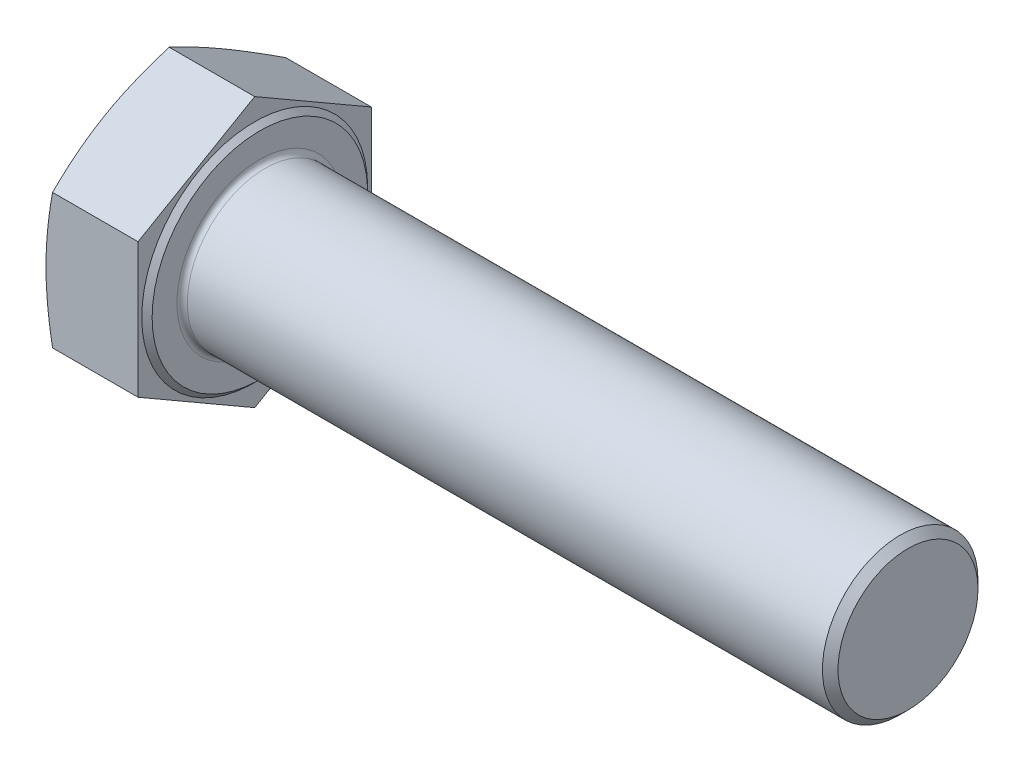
ISO-10303-21;
HEADER;
FILE_DESCRIPTION(('STEP AP214'),'2;1');
FILE_NAME('part.step','',(''),(''),'','','');
FILE_SCHEMA(('AUTOMOTIVE_DESIGN { 1 0 10303 214 1 1 1 1 }'));
ENDSEC;
DATA;
#1=APPLICATION_CONTEXT('core data for automotive mechanical design processes');
#2=APPLICATION_PROTOCOL_DEFINITION('international standard','automotive_design',2000,#1);
#3=PRODUCT_CONTEXT('',#1,'mechanical');
#4=PRODUCT('Part','Part','',(#3));
#5=PRODUCT_RELATED_PRODUCT_CATEGORY('part','',(#4));
#6=PRODUCT_DEFINITION_FORMATION('','',#4);
#7=PRODUCT_DEFINITION_CONTEXT('part definition',#1,'design');
#8=PRODUCT_DEFINITION('design','',#6,#7);
#9=PRODUCT_DEFINITION_SHAPE('','',#8);
#10=(LENGTH_UNIT() NAMED_UNIT(*) SI_UNIT(.MILLI.,.METRE.));
#11=(NAMED_UNIT(*) PLANE_ANGLE_UNIT() SI_UNIT($,.RADIAN.));
#12=(NAMED_UNIT(*) SI_UNIT($,.STERADIAN.) SOLID_ANGLE_UNIT());
#13=UNCERTAINTY_MEASURE_WITH_UNIT(LENGTH_MEASURE(1.E-05),#10,'distance_accuracy_value','');
#14=(GEOMETRIC_REPRESENTATION_CONTEXT(3) GLOBAL_UNCERTAINTY_ASSIGNED_CONTEXT((#13)) GLOBAL_UNIT_ASSIGNED_CONTEXT((#10,
#11,#12)) REPRESENTATION_CONTEXT('',''));
#15=CARTESIAN_POINT('',(0.,0.,0.));
#16=DIRECTION('',(0.,0.,1.));
#17=DIRECTION('',(1.,0.,0.));
#18=AXIS2_PLACEMENT_3D('',#15,#16,#17);
#19=CARTESIAN_POINT('',(15.,-20.7846096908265,0.));
#20=DIRECTION('',(1.,0.,0.));
#21=DIRECTION('',(0.,0.,-1.));
#22=AXIS2_PLACEMENT_3D('',#19,#20,#21);
#23=PLANE('',#22);
#24=CARTESIAN_POINT('',(15.,0.,0.));
#25=DIRECTION('',(1.,0.,0.));
#26=DIRECTION('',(0.,0.,-1.));
#27=AXIS2_PLACEMENT_3D('',#24,#25,#26);
#28=CIRCLE('',#27,12.8);
#29=CARTESIAN_POINT('',(15.,0.,-12.8));
#30=VERTEX_POINT('',#29);
#31=EDGE_CURVE('E11',#30,#30,#28,.F.);
#32=ORIENTED_EDGE('',*,*,#31,.T.);
#33=EDGE_LOOP('',(#32));
#34=FACE_BOUND('',#33,.T.);
#35=CARTESIAN_POINT('',(15.,0.,0.));
#36=DIRECTION('',(-1.,0.,0.));
#37=DIRECTION('',(0.,0.,1.));
#38=AXIS2_PLACEMENT_3D('',#35,#36,#37);
#39=CIRCLE('',#38,16.625);
#40=CARTESIAN_POINT('',(15.,0.,16.625));
#41=VERTEX_POINT('',#40);
#42=EDGE_CURVE('E263',#41,#41,#39,.T.);
#43=ORIENTED_EDGE('',*,*,#42,.F.);
#44=EDGE_LOOP('',(#43));
#45=FACE_BOUND('',#44,.T.);
#46=ADVANCED_FACE('F32',(#34,#45),#23,.T.);
#47=CARTESIAN_POINT('',(15.,-10.3923048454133,18.));
#48=DIRECTION('',(0.,0.866025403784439,-0.5));
#49=DIRECTION('',(0.,0.5,0.866025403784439));
#50=AXIS2_PLACEMENT_3D('',#47,#48,#49);
#51=PLANE('',#50);
#52=CARTESIAN_POINT('',(1.01355706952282,-20.7847251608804,-0.000200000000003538));
#53=CARTESIAN_POINT('',(0.935229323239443,-20.5695062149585,0.372570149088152));
#54=CARTESIAN_POINT('',(0.860424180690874,-20.3539709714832,0.745888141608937));
#55=CARTESIAN_POINT('',(0.718634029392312,-19.9222385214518,1.49367068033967));
#56=CARTESIAN_POINT('',(0.651649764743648,-19.7060412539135,1.86813533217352));
#57=CARTESIAN_POINT('',(0.463525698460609,-19.0561745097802,2.99373755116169));
#58=CARTESIAN_POINT('',(0.355325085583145,-18.6215276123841,3.74656806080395));
#59=CARTESIAN_POINT('',(0.223826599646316,-17.9701027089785,4.87486909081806));
#60=CARTESIAN_POINT('',(0.185238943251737,-17.7540762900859,5.2490378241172));
#61=CARTESIAN_POINT('',(0.118600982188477,-17.3216201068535,5.99807390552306));
#62=CARTESIAN_POINT('',(0.0905502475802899,-17.105190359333,6.37294122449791));
#63=CARTESIAN_POINT('',(0.0454761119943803,-16.6721177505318,7.12304498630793));
#64=CARTESIAN_POINT('',(0.0284489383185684,-16.4554749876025,7.49828125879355));
#65=CARTESIAN_POINT('',(0.00571089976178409,-16.0220405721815,8.24901168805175));
#66=CARTESIAN_POINT('',(0.,-15.8052489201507,8.62450584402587));
#67=CARTESIAN_POINT('',(0.,-15.3716656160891,9.37549415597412));
#68=CARTESIAN_POINT('',(0.00571089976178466,-15.1548739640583,9.75098831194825));
#69=CARTESIAN_POINT('',(0.0284489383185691,-14.7214395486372,10.5017187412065));
#70=CARTESIAN_POINT('',(0.0454761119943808,-14.504796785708,10.8769550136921));
#71=CARTESIAN_POINT('',(0.0905502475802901,-14.0717241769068,11.6270587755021));
#72=CARTESIAN_POINT('',(0.118600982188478,-13.8552944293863,12.0019260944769));
#73=CARTESIAN_POINT('',(0.185238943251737,-13.4228382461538,12.7509621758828));
#74=CARTESIAN_POINT('',(0.223826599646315,-13.2068118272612,13.1251309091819));
#75=CARTESIAN_POINT('',(0.355325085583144,-12.5553869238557,14.253431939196));
#76=CARTESIAN_POINT('',(0.46352569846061,-12.1207400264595,15.0062624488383));
#77=CARTESIAN_POINT('',(0.651649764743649,-11.4708732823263,16.1318646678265));
#78=CARTESIAN_POINT('',(0.718634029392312,-11.254676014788,16.5063293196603));
#79=CARTESIAN_POINT('',(0.860424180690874,-10.8229435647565,17.2541118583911));
#80=CARTESIAN_POINT('',(0.935229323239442,-10.6074083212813,17.6274298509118));
#81=CARTESIAN_POINT('',(1.01355706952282,-10.3921893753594,18.0002));
#82=B_SPLINE_CURVE_WITH_KNOTS('',3,(#52,#53,#54,#55,#56,#57,#58,#59,#60,#61,#62,#63,#64,#65,#66,
#67,#68,#69,#70,#71,#72,#73,#74,#75,#76,#77,#78,#79,#80,#81),.UNSPECIFIED.,.F.,.F.,(4,2,2,2,2,2,
2,2,2,2,2,2,2,2,4),(0.,1.31248077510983,2.62508632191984,5.25211195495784,6.55332710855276,
7.85448916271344,9.15520567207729,10.4559181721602,11.7566306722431,13.0573471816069,
14.3585092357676,15.6597243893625,18.2867500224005,19.5993555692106,20.9118363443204),.UNSPECIFIED.);
#83=CARTESIAN_POINT('',(1.01351504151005,-20.7846096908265,0.));
#84=VERTEX_POINT('',#83);
#85=CARTESIAN_POINT('',(0.,-15.5884572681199,9.));
#86=VERTEX_POINT('',#85);
#87=EDGE_CURVE('E277',#84,#86,#82,.T.);
#88=ORIENTED_EDGE('',*,*,#87,.F.);
#89=DIRECTION('',(-1.,0.,0.));
#90=VECTOR('',#89,1.);
#91=CARTESIAN_POINT('',(15.,-20.7846096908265,0.));
#92=LINE('',#91,#90);
#93=CARTESIAN_POINT('',(14.2,-20.7846096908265,0.));
#94=VERTEX_POINT('',#93);
#95=EDGE_CURVE('E142',#94,#84,#92,.T.);
#96=ORIENTED_EDGE('',*,*,#95,.F.);
#97=DIRECTION('',(0.,-0.5,-0.866025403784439));
#98=VECTOR('',#97,1.);
#99=CARTESIAN_POINT('',(14.2,-10.3923048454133,18.));
#100=LINE('',#99,#98);
#101=CARTESIAN_POINT('',(14.2,-10.3923048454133,18.));
#102=VERTEX_POINT('',#101);
#103=EDGE_CURVE('E133',#102,#94,#100,.T.);
#104=ORIENTED_EDGE('',*,*,#103,.F.);
#105=DIRECTION('',(-1.,0.,0.));
#106=VECTOR('',#105,1.);
#107=CARTESIAN_POINT('',(15.,-10.3923048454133,18.));
#108=LINE('',#107,#106);
#109=CARTESIAN_POINT('',(1.01351504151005,-10.3923048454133,18.));
#110=VERTEX_POINT('',#109);
#111=EDGE_CURVE('E128',#102,#110,#108,.T.);
#112=ORIENTED_EDGE('',*,*,#111,.T.);
#113=EDGE_CURVE('E121',#86,#110,#82,.T.);
#114=ORIENTED_EDGE('',*,*,#113,.F.);
#115=EDGE_LOOP('',(#88,#96,#104,#112,#114));
#116=FACE_BOUND('',#115,.T.);
#117=ADVANCED_FACE('F34',(#116),#51,.F.);
#118=CARTESIAN_POINT('',(15.,-20.7846096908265,0.));
#119=DIRECTION('',(0.,0.866025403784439,0.5));
#120=DIRECTION('',(0.,-0.5,0.866025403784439));
#121=AXIS2_PLACEMENT_3D('',#118,#119,#120);
#122=PLANE('',#121);
#123=CARTESIAN_POINT('',(1.01355706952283,-10.3921893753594,-18.0002));
#124=CARTESIAN_POINT('',(0.935229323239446,-10.6074083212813,-17.6274298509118));
#125=CARTESIAN_POINT('',(0.860424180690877,-10.8229435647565,-17.2541118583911));
#126=CARTESIAN_POINT('',(0.718634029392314,-11.254676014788,-16.5063293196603));
#127=CARTESIAN_POINT('',(0.65164976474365,-11.4708732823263,-16.1318646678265));
#128=CARTESIAN_POINT('',(0.463525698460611,-12.1207400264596,-15.0062624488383));
#129=CARTESIAN_POINT('',(0.355325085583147,-12.5553869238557,-14.253431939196));
#130=CARTESIAN_POINT('',(0.223826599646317,-13.2068118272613,-13.1251309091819));
#131=CARTESIAN_POINT('',(0.185238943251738,-13.4228382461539,-12.7509621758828));
#132=CARTESIAN_POINT('',(0.118600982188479,-13.8552944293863,-12.0019260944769));
#133=CARTESIAN_POINT('',(0.0905502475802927,-14.0717241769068,-11.6270587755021));
#134=CARTESIAN_POINT('',(0.0454761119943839,-14.504796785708,-10.8769550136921));
#135=CARTESIAN_POINT('',(0.0284489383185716,-14.7214395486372,-10.5017187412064));
#136=CARTESIAN_POINT('',(0.00571089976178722,-15.1548739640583,-9.75098831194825));
#137=CARTESIAN_POINT('',(0.,-15.3716656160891,-9.37549415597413));
#138=CARTESIAN_POINT('',(0.,-15.8052489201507,-8.62450584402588));
#139=CARTESIAN_POINT('',(0.00571089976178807,-16.0220405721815,-8.24901168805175));
#140=CARTESIAN_POINT('',(0.028448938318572,-16.4554749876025,-7.49828125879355));
#141=CARTESIAN_POINT('',(0.0454761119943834,-16.6721177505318,-7.12304498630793));
#142=CARTESIAN_POINT('',(0.0905502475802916,-17.105190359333,-6.37294122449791));
#143=CARTESIAN_POINT('',(0.118600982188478,-17.3216201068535,-5.99807390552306));
#144=CARTESIAN_POINT('',(0.185238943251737,-17.7540762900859,-5.24903782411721));
#145=CARTESIAN_POINT('',(0.223826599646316,-17.9701027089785,-4.87486909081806));
#146=CARTESIAN_POINT('',(0.355325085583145,-18.6215276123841,-3.74656806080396));
#147=CARTESIAN_POINT('',(0.463525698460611,-19.0561745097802,-2.99373755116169));
#148=CARTESIAN_POINT('',(0.65164976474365,-19.7060412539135,-1.86813533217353));
#149=CARTESIAN_POINT('',(0.718634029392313,-19.9222385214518,-1.49367068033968));
#150=CARTESIAN_POINT('',(0.860424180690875,-20.3539709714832,-0.745888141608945));
#151=CARTESIAN_POINT('',(0.935229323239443,-20.5695062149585,-0.372570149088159));
#152=CARTESIAN_POINT('',(1.01355706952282,-20.7847251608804,0.000199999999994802));
#153=B_SPLINE_CURVE_WITH_KNOTS('',3,(#123,#124,#125,#126,#127,#128,#129,#130,#131,#132,#133,
#134,#135,#136,#137,#138,#139,#140,#141,#142,#143,#144,#145,#146,#147,#148,#149,#150,#151,#152),
.UNSPECIFIED.,.F.,.F.,(4,2,2,2,2,2,2,2,2,2,2,2,2,2,4),(0.,1.31248077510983,2.62508632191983,
5.25211195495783,6.55332710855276,7.85448916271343,9.15520567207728,10.4559181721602,
11.7566306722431,13.0573471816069,14.3585092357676,15.6597243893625,18.2867500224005,
19.5993555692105,20.9118363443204),.UNSPECIFIED.);
#154=CARTESIAN_POINT('',(1.01351504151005,-10.3923048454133,-18.));
#155=VERTEX_POINT('',#154);
#156=CARTESIAN_POINT('',(0.,-15.5884572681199,-9.));
#157=VERTEX_POINT('',#156);
#158=EDGE_CURVE('E230',#155,#157,#153,.T.);
#159=ORIENTED_EDGE('',*,*,#158,.F.);
#160=DIRECTION('',(-1.,0.,0.));
#161=VECTOR('',#160,1.);
#162=CARTESIAN_POINT('',(15.,-10.3923048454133,-18.));
#163=LINE('',#162,#161);
#164=CARTESIAN_POINT('',(14.2,-10.3923048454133,-18.));
#165=VERTEX_POINT('',#164);
#166=EDGE_CURVE('E139',#165,#155,#163,.T.);
#167=ORIENTED_EDGE('',*,*,#166,.F.);
#168=DIRECTION('',(0.,0.5,-0.866025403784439));
#169=VECTOR('',#168,1.);
#170=CARTESIAN_POINT('',(14.2,-20.7846096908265,0.));
#171=LINE('',#170,#169);
#172=EDGE_CURVE('E267',#94,#165,#171,.T.);
#173=ORIENTED_EDGE('',*,*,#172,.F.);
#174=ORIENTED_EDGE('',*,*,#95,.T.);
#175=EDGE_CURVE('E226',#157,#84,#153,.T.);
#176=ORIENTED_EDGE('',*,*,#175,.F.);
#177=EDGE_LOOP('',(#159,#167,#173,#174,#176));
#178=FACE_BOUND('',#177,.T.);
#179=ADVANCED_FACE('F180',(#178),#122,.F.);
#180=CARTESIAN_POINT('',(15.,-10.3923048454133,-18.));
#181=DIRECTION('',(0.,0.,1.));
#182=DIRECTION('',(1.,0.,0.));
#183=AXIS2_PLACEMENT_3D('',#180,#181,#182);
#184=PLANE('',#183);
#185=CARTESIAN_POINT('',(5.41582244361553,-27.5151690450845,-18.));
#186=CARTESIAN_POINT('',(5.2918021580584,-27.1079824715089,-18.));
#187=CARTESIAN_POINT('',(5.16853188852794,-26.7005675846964,-18.));
#188=CARTESIAN_POINT('',(4.92365928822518,-25.8852344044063,-18.));
#189=CARTESIAN_POINT('',(4.80205696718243,-25.4773161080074,-18.));
#190=CARTESIAN_POINT('',(4.43998810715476,-24.2526827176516,-18.));
#191=CARTESIAN_POINT('',(4.20227805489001,-23.4351493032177,-18.));
#192=CARTESIAN_POINT('',(3.73546671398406,-21.7959728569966,-18.));
#193=CARTESIAN_POINT('',(3.50638231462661,-20.9743250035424,-18.));
#194=CARTESIAN_POINT('',(3.05948461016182,-19.3279732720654,-18.));
#195=CARTESIAN_POINT('',(2.84167110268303,-18.5032694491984,-18.));
#196=CARTESIAN_POINT('',(2.42271166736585,-16.8604466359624,-18.));
#197=CARTESIAN_POINT('',(2.22139334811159,-16.0423718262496,-18.));
#198=CARTESIAN_POINT('',(1.83589627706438,-14.4021513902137,-18.));
#199=CARTESIAN_POINT('',(1.6517178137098,-13.5800056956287,-18.));
#200=CARTESIAN_POINT('',(1.30479477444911,-11.9314594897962,-18.));
#201=CARTESIAN_POINT('',(1.14204288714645,-11.1050605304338,-18.));
#202=CARTESIAN_POINT('',(0.842928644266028,-9.44746479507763,-18.));
#203=CARTESIAN_POINT('',(0.706565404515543,-8.61626818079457,-18.));
#204=CARTESIAN_POINT('',(0.479270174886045,-7.0426731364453,-18.));
#205=CARTESIAN_POINT('',(0.384958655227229,-6.30076744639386,-18.));
#206=CARTESIAN_POINT('',(0.225311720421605,-4.81381892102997,-18.));
#207=CARTESIAN_POINT('',(0.159975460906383,-4.06877617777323,-18.));
#208=CARTESIAN_POINT('',(0.0614255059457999,-2.57706476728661,-18.));
#209=CARTESIAN_POINT('',(0.0281890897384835,-1.83039762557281,-18.));
#210=CARTESIAN_POINT('',(-0.00447842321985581,-0.336316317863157,-18.));
#211=CARTESIAN_POINT('',(-0.0039097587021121,0.411097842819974,-18.));
#212=CARTESIAN_POINT('',(0.0310905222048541,1.90891227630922,-18.));
#213=CARTESIAN_POINT('',(0.065693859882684,2.65930846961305,-18.));
#214=CARTESIAN_POINT('',(0.167171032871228,4.15789675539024,-18.));
#215=CARTESIAN_POINT('',(0.234045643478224,4.90608879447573,-18.));
#216=CARTESIAN_POINT('',(0.39693700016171,6.39989932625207,-18.));
#217=CARTESIAN_POINT('',(0.49297877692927,7.1455150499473,-18.));
#218=CARTESIAN_POINT('',(0.710308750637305,8.63301636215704,-18.));
#219=CARTESIAN_POINT('',(0.831597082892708,9.37490193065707,-18.));
#220=CARTESIAN_POINT('',(1.1024521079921,10.8939822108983,-18.));
#221=CARTESIAN_POINT('',(1.25317523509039,11.6709688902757,-18.));
#222=CARTESIAN_POINT('',(1.57402044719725,13.2209522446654,-18.));
#223=CARTESIAN_POINT('',(1.74414399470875,13.9939486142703,-18.));
#224=CARTESIAN_POINT('',(2.10021780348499,15.5365021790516,-18.));
#225=CARTESIAN_POINT('',(2.28617266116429,16.3060583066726,-18.));
#226=CARTESIAN_POINT('',(2.67088415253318,17.8419287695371,-18.));
#227=CARTESIAN_POINT('',(2.86964047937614,18.6082431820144,-18.));
#228=CARTESIAN_POINT('',(3.27782395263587,20.139068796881,-18.));
#229=CARTESIAN_POINT('',(3.48726447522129,20.9035764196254,-18.));
#230=CARTESIAN_POINT('',(3.91466536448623,22.4302031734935,-18.));
#231=CARTESIAN_POINT('',(4.1326257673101,23.1923222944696,-18.));
#232=CARTESIAN_POINT('',(4.57550689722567,24.7143923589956,-18.));
#233=CARTESIAN_POINT('',(4.80042645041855,25.4743436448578,-18.));
#234=CARTESIAN_POINT('',(5.25605194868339,26.9925048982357,-18.));
#235=CARTESIAN_POINT('',(5.48675788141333,27.7507148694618,-18.));
#236=CARTESIAN_POINT('',(5.95041678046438,29.2572852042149,-18.));
#237=CARTESIAN_POINT('',(6.1833168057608,30.0056618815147,-18.));
#238=CARTESIAN_POINT('',(6.65308922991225,31.5011682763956,-18.));
#239=CARTESIAN_POINT('',(6.88996164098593,32.2482979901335,-18.));
#240=CARTESIAN_POINT('',(7.6056155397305,34.4881493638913,-18.));
#241=CARTESIAN_POINT('',(8.08941377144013,35.9792689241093,-18.));
#242=CARTESIAN_POINT('',(8.82151197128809,38.2107066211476,-18.));
#243=CARTESIAN_POINT('',(9.06613879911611,38.9522359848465,-18.));
#244=CARTESIAN_POINT('',(9.55750817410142,40.4345945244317,-18.));
#245=CARTESIAN_POINT('',(9.80425072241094,41.1754236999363,-18.));
#246=CARTESIAN_POINT('',(10.2995471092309,42.6564083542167,-18.));
#247=CARTESIAN_POINT('',(10.5481007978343,43.3965638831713,-18.));
#248=CARTESIAN_POINT('',(11.0468164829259,44.8763309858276,-18.));
#249=CARTESIAN_POINT('',(11.2969784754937,45.6159425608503,-18.));
#250=CARTESIAN_POINT('',(11.5478337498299,46.355318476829,-18.));
#251=B_SPLINE_CURVE_WITH_KNOTS('',3,(#185,#186,#187,#188,#189,#190,#191,#192,#193,#194,#195,
#196,#197,#198,#199,#200,#201,#202,#203,#204,#205,#206,#207,#208,#209,#210,#211,#212,#213,#214,
#215,#216,#217,#218,#219,#220,#221,#222,#223,#224,#225,#226,#227,#228,#229,#230,#231,#232,#233,
#234,#235,#236,#237,#238,#239,#240,#241,#242,#243,#244,#245,#246,#247,#248,#249,#250),
.UNSPECIFIED.,.F.,.F.,(4,2,2,2,2,2,2,2,2,2,2,2,2,2,2,2,2,2,2,2,2,2,2,2,2,2,2,2,2,2,2,2,4),(0.,
1.27696278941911,2.55393302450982,5.10806226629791,7.6669568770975,10.2258055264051,
12.7531049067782,15.280446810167,17.8069240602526,20.3333166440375,22.576452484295,
24.8195229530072,27.0610045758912,29.3024703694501,31.555303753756,33.8081912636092,
36.0630176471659,38.3178561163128,40.6919643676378,43.0662517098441,45.4412307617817,
47.8161529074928,50.1941250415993,52.5721072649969,54.9496905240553,57.3272687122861,
59.6785935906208,62.0299257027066,66.7327919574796,69.075304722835,71.4178187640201,
73.7601410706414,76.1024576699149),.UNSPECIFIED.);
#252=CARTESIAN_POINT('',(1.01351504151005,10.3923048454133,-18.));
#253=VERTEX_POINT('',#252);
#254=CARTESIAN_POINT('',(0.,0.,-18.));
#255=VERTEX_POINT('',#254);
#256=EDGE_CURVE('E293',#253,#255,#251,.F.);
#257=ORIENTED_EDGE('',*,*,#256,.F.);
#258=DIRECTION('',(-1.,0.,0.));
#259=VECTOR('',#258,1.);
#260=CARTESIAN_POINT('',(15.,10.3923048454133,-18.));
#261=LINE('',#260,#259);
#262=CARTESIAN_POINT('',(14.2,10.3923048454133,-18.));
#263=VERTEX_POINT('',#262);
#264=EDGE_CURVE('E130',#263,#253,#261,.T.);
#265=ORIENTED_EDGE('',*,*,#264,.F.);
#266=DIRECTION('',(0.,1.,0.));
#267=VECTOR('',#266,1.);
#268=CARTESIAN_POINT('',(14.2,-10.3923048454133,-18.));
#269=LINE('',#268,#267);
#270=EDGE_CURVE('E260',#165,#263,#269,.T.);
#271=ORIENTED_EDGE('',*,*,#270,.F.);
#272=ORIENTED_EDGE('',*,*,#166,.T.);
#273=EDGE_CURVE('E231',#255,#155,#251,.F.);
#274=ORIENTED_EDGE('',*,*,#273,.F.);
#275=EDGE_LOOP('',(#257,#265,#271,#272,#274));
#276=FACE_BOUND('',#275,.T.);
#277=ADVANCED_FACE('F239',(#276),#184,.F.);
#278=CARTESIAN_POINT('',(15.,10.3923048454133,-18.));
#279=DIRECTION('',(0.,-0.866025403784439,0.5));
#280=DIRECTION('',(0.,-0.5,-0.866025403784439));
#281=AXIS2_PLACEMENT_3D('',#278,#279,#280);
#282=PLANE('',#281);
#283=CARTESIAN_POINT('',(1.01355706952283,20.7847251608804,0.000199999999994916));
#284=CARTESIAN_POINT('',(0.93522932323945,20.5695062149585,-0.372570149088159));
#285=CARTESIAN_POINT('',(0.860424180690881,20.3539709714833,-0.745888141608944));
#286=CARTESIAN_POINT('',(0.71863402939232,19.9222385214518,-1.49367068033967));
#287=CARTESIAN_POINT('',(0.651649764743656,19.7060412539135,-1.86813533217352));
#288=CARTESIAN_POINT('',(0.463525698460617,19.0561745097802,-2.99373755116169));
#289=CARTESIAN_POINT('',(0.355325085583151,18.6215276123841,-3.74656806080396));
#290=CARTESIAN_POINT('',(0.223826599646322,17.9701027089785,-4.87486909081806));
#291=CARTESIAN_POINT('',(0.185238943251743,17.7540762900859,-5.24903782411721));
#292=CARTESIAN_POINT('',(0.118600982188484,17.3216201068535,-5.99807390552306));
#293=CARTESIAN_POINT('',(0.0905502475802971,17.105190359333,-6.37294122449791));
#294=CARTESIAN_POINT('',(0.0454761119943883,16.6721177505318,-7.12304498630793));
#295=CARTESIAN_POINT('',(0.0284489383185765,16.4554749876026,-7.49828125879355));
#296=CARTESIAN_POINT('',(0.00571089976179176,16.0220405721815,-8.24901168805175));
#297=CARTESIAN_POINT('',(0.,15.8052489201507,-8.62450584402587));
#298=CARTESIAN_POINT('',(0.,15.3716656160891,-9.37549415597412));
#299=CARTESIAN_POINT('',(0.00571089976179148,15.1548739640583,-9.75098831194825));
#300=CARTESIAN_POINT('',(0.0284489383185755,14.7214395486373,-10.5017187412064));
#301=CARTESIAN_POINT('',(0.0454761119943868,14.504796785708,-10.8769550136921));
#302=CARTESIAN_POINT('',(0.0905502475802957,14.0717241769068,-11.6270587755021));
#303=CARTESIAN_POINT('',(0.118600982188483,13.8552944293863,-12.0019260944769));
#304=CARTESIAN_POINT('',(0.185238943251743,13.4228382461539,-12.7509621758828));
#305=CARTESIAN_POINT('',(0.223826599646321,13.2068118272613,-13.1251309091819));
#306=CARTESIAN_POINT('',(0.35532508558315,12.5553869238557,-14.253431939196));
#307=CARTESIAN_POINT('',(0.463525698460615,12.1207400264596,-15.0062624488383));
#308=CARTESIAN_POINT('',(0.651649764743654,11.4708732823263,-16.1318646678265));
#309=CARTESIAN_POINT('',(0.718634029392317,11.254676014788,-16.5063293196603));
#310=CARTESIAN_POINT('',(0.860424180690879,10.8229435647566,-17.2541118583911));
#311=CARTESIAN_POINT('',(0.935229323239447,10.6074083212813,-17.6274298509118));
#312=CARTESIAN_POINT('',(1.01355706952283,10.3921893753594,-18.0002));
#313=B_SPLINE_CURVE_WITH_KNOTS('',3,(#283,#284,#285,#286,#287,#288,#289,#290,#291,#292,#293,
#294,#295,#296,#297,#298,#299,#300,#301,#302,#303,#304,#305,#306,#307,#308,#309,#310,#311,#312),
.UNSPECIFIED.,.F.,.F.,(4,2,2,2,2,2,2,2,2,2,2,2,2,2,4),(0.,1.31248077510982,2.62508632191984,
5.25211195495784,6.55332710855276,7.85448916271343,9.15520567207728,10.4559181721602,
11.7566306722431,13.0573471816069,14.3585092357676,15.6597243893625,18.2867500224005,
19.5993555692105,20.9118363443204),.UNSPECIFIED.);
#314=CARTESIAN_POINT('',(1.01351504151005,20.7846096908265,0.));
#315=VERTEX_POINT('',#314);
#316=CARTESIAN_POINT('',(0.,15.5884572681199,-9.));
#317=VERTEX_POINT('',#316);
#318=EDGE_CURVE('E48',#315,#317,#313,.T.);
#319=ORIENTED_EDGE('',*,*,#318,.F.);
#320=DIRECTION('',(-1.,0.,0.));
#321=VECTOR('',#320,1.);
#322=CARTESIAN_POINT('',(15.,20.7846096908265,0.));
#323=LINE('',#322,#321);
#324=CARTESIAN_POINT('',(14.2,20.7846096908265,0.));
#325=VERTEX_POINT('',#324);
#326=EDGE_CURVE('E127',#325,#315,#323,.T.);
#327=ORIENTED_EDGE('',*,*,#326,.F.);
#328=DIRECTION('',(0.,0.5,0.866025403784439));
#329=VECTOR('',#328,1.);
#330=CARTESIAN_POINT('',(14.2,10.3923048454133,-18.));
#331=LINE('',#330,#329);
#332=EDGE_CURVE('E257',#263,#325,#331,.T.);
#333=ORIENTED_EDGE('',*,*,#332,.F.);
#334=ORIENTED_EDGE('',*,*,#264,.T.);
#335=EDGE_CURVE('E254',#317,#253,#313,.T.);
#336=ORIENTED_EDGE('',*,*,#335,.F.);
#337=EDGE_LOOP('',(#319,#327,#333,#334,#336));
#338=FACE_BOUND('',#337,.T.);
#339=ADVANCED_FACE('F243',(#338),#282,.F.);
#340=CARTESIAN_POINT('',(15.,20.7846096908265,0.));
#341=DIRECTION('',(0.,-0.866025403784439,-0.5));
#342=DIRECTION('',(0.,0.5,-0.866025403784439));
#343=AXIS2_PLACEMENT_3D('',#340,#341,#342);
#344=PLANE('',#343);
#345=CARTESIAN_POINT('',(1.01355706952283,10.3921893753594,18.0002));
#346=CARTESIAN_POINT('',(0.935229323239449,10.6074083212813,17.6274298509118));
#347=CARTESIAN_POINT('',(0.860424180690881,10.8229435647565,17.2541118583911));
#348=CARTESIAN_POINT('',(0.718634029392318,11.254676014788,16.5063293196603));
#349=CARTESIAN_POINT('',(0.651649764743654,11.4708732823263,16.1318646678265));
#350=CARTESIAN_POINT('',(0.463525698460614,12.1207400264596,15.0062624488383));
#351=CARTESIAN_POINT('',(0.35532508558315,12.5553869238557,14.253431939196));
#352=CARTESIAN_POINT('',(0.223826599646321,13.2068118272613,13.1251309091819));
#353=CARTESIAN_POINT('',(0.185238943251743,13.4228382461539,12.7509621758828));
#354=CARTESIAN_POINT('',(0.118600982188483,13.8552944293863,12.0019260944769));
#355=CARTESIAN_POINT('',(0.0905502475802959,14.0717241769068,11.6270587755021));
#356=CARTESIAN_POINT('',(0.045476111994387,14.504796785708,10.8769550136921));
#357=CARTESIAN_POINT('',(0.0284489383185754,14.7214395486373,10.5017187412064));
#358=CARTESIAN_POINT('',(0.00571089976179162,15.1548739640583,9.75098831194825));
#359=CARTESIAN_POINT('',(0.,15.3716656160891,9.37549415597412));
#360=CARTESIAN_POINT('',(0.,15.8052489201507,8.62450584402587));
#361=CARTESIAN_POINT('',(0.00571089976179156,16.0220405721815,8.24901168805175));
#362=CARTESIAN_POINT('',(0.0284489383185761,16.4554749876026,7.49828125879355));
#363=CARTESIAN_POINT('',(0.0454761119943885,16.6721177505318,7.12304498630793));
#364=CARTESIAN_POINT('',(0.0905502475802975,17.105190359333,6.3729412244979));
#365=CARTESIAN_POINT('',(0.118600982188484,17.3216201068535,5.99807390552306));
#366=CARTESIAN_POINT('',(0.185238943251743,17.7540762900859,5.2490378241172));
#367=CARTESIAN_POINT('',(0.223826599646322,17.9701027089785,4.87486909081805));
#368=CARTESIAN_POINT('',(0.355325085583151,18.6215276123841,3.74656806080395));
#369=CARTESIAN_POINT('',(0.463525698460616,19.0561745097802,2.99373755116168));
#370=CARTESIAN_POINT('',(0.651649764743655,19.7060412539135,1.86813533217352));
#371=CARTESIAN_POINT('',(0.71863402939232,19.9222385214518,1.49367068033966));
#372=CARTESIAN_POINT('',(0.860424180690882,20.3539709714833,0.745888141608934));
#373=CARTESIAN_POINT('',(0.93522932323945,20.5695062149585,0.372570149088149));
#374=CARTESIAN_POINT('',(1.01355706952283,20.7847251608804,-0.000200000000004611));
#375=B_SPLINE_CURVE_WITH_KNOTS('',3,(#345,#346,#347,#348,#349,#350,#351,#352,#353,#354,#355,
#356,#357,#358,#359,#360,#361,#362,#363,#364,#365,#366,#367,#368,#369,#370,#371,#372,#373,#374),
.UNSPECIFIED.,.F.,.F.,(4,2,2,2,2,2,2,2,2,2,2,2,2,2,4),(0.,1.31248077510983,2.62508632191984,
5.25211195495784,6.55332710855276,7.85448916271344,9.15520567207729,10.4559181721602,
11.7566306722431,13.0573471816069,14.3585092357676,15.6597243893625,18.2867500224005,
19.5993555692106,20.9118363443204),.UNSPECIFIED.);
#376=CARTESIAN_POINT('',(1.01351504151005,10.3923048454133,18.));
#377=VERTEX_POINT('',#376);
#378=CARTESIAN_POINT('',(0.,15.5884572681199,9.));
#379=VERTEX_POINT('',#378);
#380=EDGE_CURVE('E56',#377,#379,#375,.T.);
#381=ORIENTED_EDGE('',*,*,#380,.F.);
#382=DIRECTION('',(-1.,0.,0.));
#383=VECTOR('',#382,1.);
#384=CARTESIAN_POINT('',(15.,10.3923048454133,18.));
#385=LINE('',#384,#383);
#386=CARTESIAN_POINT('',(14.2,10.3923048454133,18.));
#387=VERTEX_POINT('',#386);
#388=EDGE_CURVE('E118',#387,#377,#385,.T.);
#389=ORIENTED_EDGE('',*,*,#388,.F.);
#390=DIRECTION('',(0.,-0.5,0.866025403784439));
#391=VECTOR('',#390,1.);
#392=CARTESIAN_POINT('',(14.2,20.7846096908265,0.));
#393=LINE('',#392,#391);
#394=EDGE_CURVE('E255',#325,#387,#393,.T.);
#395=ORIENTED_EDGE('',*,*,#394,.F.);
#396=ORIENTED_EDGE('',*,*,#326,.T.);
#397=EDGE_CURVE('E120',#379,#315,#375,.T.);
#398=ORIENTED_EDGE('',*,*,#397,.F.);
#399=EDGE_LOOP('',(#381,#389,#395,#396,#398));
#400=FACE_BOUND('',#399,.T.);
#401=ADVANCED_FACE('F116',(#400),#344,.F.);
#402=CARTESIAN_POINT('',(15.,10.3923048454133,18.));
#403=DIRECTION('',(0.,0.,-1.));
#404=DIRECTION('',(-1.,0.,0.));
#405=AXIS2_PLACEMENT_3D('',#402,#403,#404);
#406=PLANE('',#405);
#407=CARTESIAN_POINT('',(5.41582244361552,-27.5151690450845,18.));
#408=CARTESIAN_POINT('',(5.29180215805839,-27.1079824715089,18.));
#409=CARTESIAN_POINT('',(5.16853188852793,-26.7005675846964,18.));
#410=CARTESIAN_POINT('',(4.92365928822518,-25.8852344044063,18.));
#411=CARTESIAN_POINT('',(4.80205696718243,-25.4773161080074,18.));
#412=CARTESIAN_POINT('',(4.43998810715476,-24.2526827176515,18.));
#413=CARTESIAN_POINT('',(4.20227805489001,-23.4351493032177,18.));
#414=CARTESIAN_POINT('',(3.73546671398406,-21.7959728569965,18.));
#415=CARTESIAN_POINT('',(3.50638231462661,-20.9743250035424,18.));
#416=CARTESIAN_POINT('',(3.05948461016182,-19.3279732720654,18.));
#417=CARTESIAN_POINT('',(2.84167110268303,-18.5032694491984,18.));
#418=CARTESIAN_POINT('',(2.42271166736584,-16.8604466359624,18.));
#419=CARTESIAN_POINT('',(2.22139334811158,-16.0423718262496,18.));
#420=CARTESIAN_POINT('',(1.83589627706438,-14.4021513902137,18.));
#421=CARTESIAN_POINT('',(1.6517178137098,-13.5800056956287,18.));
#422=CARTESIAN_POINT('',(1.30479477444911,-11.9314594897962,18.));
#423=CARTESIAN_POINT('',(1.14204288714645,-11.1050605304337,18.));
#424=CARTESIAN_POINT('',(0.842928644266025,-9.44746479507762,18.));
#425=CARTESIAN_POINT('',(0.706565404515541,-8.61626818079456,18.));
#426=CARTESIAN_POINT('',(0.479270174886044,-7.04267313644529,18.));
#427=CARTESIAN_POINT('',(0.384958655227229,-6.30076744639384,18.));
#428=CARTESIAN_POINT('',(0.225311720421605,-4.81381892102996,18.));
#429=CARTESIAN_POINT('',(0.159975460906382,-4.06877617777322,18.));
#430=CARTESIAN_POINT('',(0.0614255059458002,-2.5770647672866,18.));
#431=CARTESIAN_POINT('',(0.0281890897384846,-1.8303976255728,18.));
#432=CARTESIAN_POINT('',(-0.00447842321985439,-0.336316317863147,18.));
#433=CARTESIAN_POINT('',(-0.0039097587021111,0.411097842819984,18.));
#434=CARTESIAN_POINT('',(0.0310905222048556,1.90891227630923,18.));
#435=CARTESIAN_POINT('',(0.0656938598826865,2.65930846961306,18.));
#436=CARTESIAN_POINT('',(0.167171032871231,4.15789675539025,18.));
#437=CARTESIAN_POINT('',(0.234045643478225,4.90608879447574,18.));
#438=CARTESIAN_POINT('',(0.396937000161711,6.39989932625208,18.));
#439=CARTESIAN_POINT('',(0.492978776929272,7.14551504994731,18.));
#440=CARTESIAN_POINT('',(0.710308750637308,8.63301636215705,18.));
#441=CARTESIAN_POINT('',(0.83159708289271,9.37490193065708,18.));
#442=CARTESIAN_POINT('',(1.1024521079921,10.8939822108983,18.));
#443=CARTESIAN_POINT('',(1.25317523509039,11.6709688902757,18.));
#444=CARTESIAN_POINT('',(1.57402044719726,13.2209522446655,18.));
#445=CARTESIAN_POINT('',(1.74414399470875,13.9939486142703,18.));
#446=CARTESIAN_POINT('',(2.10021780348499,15.5365021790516,18.));
#447=CARTESIAN_POINT('',(2.2861726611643,16.3060583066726,18.));
#448=CARTESIAN_POINT('',(2.67088415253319,17.8419287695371,18.));
#449=CARTESIAN_POINT('',(2.86964047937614,18.6082431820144,18.));
#450=CARTESIAN_POINT('',(3.27782395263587,20.139068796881,18.));
#451=CARTESIAN_POINT('',(3.48726447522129,20.9035764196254,18.));
#452=CARTESIAN_POINT('',(3.91466536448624,22.4302031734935,18.));
#453=CARTESIAN_POINT('',(4.13262576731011,23.1923222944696,18.));
#454=CARTESIAN_POINT('',(4.57550689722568,24.7143923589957,18.));
#455=CARTESIAN_POINT('',(4.80042645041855,25.4743436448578,18.));
#456=CARTESIAN_POINT('',(5.2560519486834,26.9925048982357,18.));
#457=CARTESIAN_POINT('',(5.48675788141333,27.7507148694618,18.));
#458=CARTESIAN_POINT('',(5.95041678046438,29.2572852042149,18.));
#459=CARTESIAN_POINT('',(6.1833168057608,30.0056618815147,18.));
#460=CARTESIAN_POINT('',(6.65308922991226,31.5011682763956,18.));
#461=CARTESIAN_POINT('',(6.88996164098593,32.2482979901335,18.));
#462=CARTESIAN_POINT('',(7.6056155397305,34.4881493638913,18.));
#463=CARTESIAN_POINT('',(8.08941377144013,35.9792689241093,18.));
#464=CARTESIAN_POINT('',(8.82151197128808,38.2107066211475,18.));
#465=CARTESIAN_POINT('',(9.0661387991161,38.9522359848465,18.));
#466=CARTESIAN_POINT('',(9.5575081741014,40.4345945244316,18.));
#467=CARTESIAN_POINT('',(9.80425072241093,41.1754236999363,18.));
#468=CARTESIAN_POINT('',(10.2995471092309,42.6564083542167,18.));
#469=CARTESIAN_POINT('',(10.5481007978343,43.3965638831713,18.));
#470=CARTESIAN_POINT('',(11.0468164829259,44.8763309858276,18.));
#471=CARTESIAN_POINT('',(11.2969784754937,45.6159425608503,18.));
#472=CARTESIAN_POINT('',(11.5478337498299,46.355318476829,18.));
#473=B_SPLINE_CURVE_WITH_KNOTS('',3,(#407,#408,#409,#410,#411,#412,#413,#414,#415,#416,#417,
#418,#419,#420,#421,#422,#423,#424,#425,#426,#427,#428,#429,#430,#431,#432,#433,#434,#435,#436,
#437,#438,#439,#440,#441,#442,#443,#444,#445,#446,#447,#448,#449,#450,#451,#452,#453,#454,#455,
#456,#457,#458,#459,#460,#461,#462,#463,#464,#465,#466,#467,#468,#469,#470,#471,#472),
.UNSPECIFIED.,.F.,.F.,(4,2,2,2,2,2,2,2,2,2,2,2,2,2,2,2,2,2,2,2,2,2,2,2,2,2,2,2,2,2,2,2,4),(0.,
1.27696278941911,2.55393302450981,5.10806226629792,7.6669568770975,10.2258055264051,
12.7531049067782,15.280446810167,17.8069240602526,20.3333166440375,22.576452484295,
24.8195229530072,27.0610045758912,29.3024703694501,31.555303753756,33.8081912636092,
36.0630176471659,38.3178561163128,40.6919643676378,43.0662517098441,45.4412307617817,
47.8161529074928,50.1941250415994,52.5721072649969,54.9496905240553,57.3272687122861,
59.6785935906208,62.0299257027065,66.7327919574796,69.0753047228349,71.4178187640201,
73.7601410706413,76.1024576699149),.UNSPECIFIED.);
#474=CARTESIAN_POINT('',(0.,0.,18.));
#475=VERTEX_POINT('',#474);
#476=EDGE_CURVE('E111',#110,#475,#473,.T.);
#477=ORIENTED_EDGE('',*,*,#476,.F.);
#478=ORIENTED_EDGE('',*,*,#111,.F.);
#479=DIRECTION('',(0.,-1.,0.));
#480=VECTOR('',#479,1.);
#481=CARTESIAN_POINT('',(14.2,10.3923048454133,18.));
#482=LINE('',#481,#480);
#483=EDGE_CURVE('E126',#387,#102,#482,.T.);
#484=ORIENTED_EDGE('',*,*,#483,.F.);
#485=ORIENTED_EDGE('',*,*,#388,.T.);
#486=EDGE_CURVE('E103',#475,#377,#473,.T.);
#487=ORIENTED_EDGE('',*,*,#486,.F.);
#488=EDGE_LOOP('',(#477,#478,#484,#485,#487));
#489=FACE_BOUND('',#488,.T.);
#490=ADVANCED_FACE('F124',(#489),#406,.F.);
#491=CARTESIAN_POINT('',(14.2,17.425,0.));
#492=DIRECTION('',(1.,0.,0.));
#493=DIRECTION('',(0.,0.,-1.));
#494=AXIS2_PLACEMENT_3D('',#491,#492,#493);
#495=PLANE('',#494);
#496=CARTESIAN_POINT('',(14.2,0.,0.));
#497=DIRECTION('',(-1.,0.,0.));
#498=DIRECTION('',(0.,0.,1.));
#499=AXIS2_PLACEMENT_3D('',#496,#497,#498);
#500=CIRCLE('',#499,17.425);
#501=CARTESIAN_POINT('',(14.2,0.,17.425));
#502=VERTEX_POINT('',#501);
#503=EDGE_CURVE('E258',#502,#502,#500,.T.);
#504=ORIENTED_EDGE('',*,*,#503,.T.);
#505=EDGE_LOOP('',(#504));
#506=FACE_BOUND('',#505,.T.);
#507=ORIENTED_EDGE('',*,*,#103,.T.);
#508=ORIENTED_EDGE('',*,*,#172,.T.);
#509=ORIENTED_EDGE('',*,*,#270,.T.);
#510=ORIENTED_EDGE('',*,*,#332,.T.);
#511=ORIENTED_EDGE('',*,*,#394,.T.);
#512=ORIENTED_EDGE('',*,*,#483,.T.);
#513=EDGE_LOOP('',(#507,#508,#509,#510,#511,#512));
#514=FACE_BOUND('',#513,.T.);
#515=ADVANCED_FACE('F190',(#506,#514),#495,.T.);
#516=CARTESIAN_POINT('',(14.2,0.,0.));
#517=DIRECTION('',(-1.,0.,0.));
#518=DIRECTION('',(0.,0.,1.));
#519=AXIS2_PLACEMENT_3D('',#516,#517,#518);
#520=CONICAL_SURFACE('',#519,17.425,0.785398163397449);
#521=ORIENTED_EDGE('',*,*,#42,.T.);
#522=EDGE_LOOP('',(#521));
#523=FACE_BOUND('',#522,.T.);
#524=ORIENTED_EDGE('',*,*,#503,.F.);
#525=EDGE_LOOP('',(#524));
#526=FACE_BOUND('',#525,.T.);
#527=ADVANCED_FACE('F211',(#523,#526),#520,.T.);
#528=CARTESIAN_POINT('',(0.,0.,0.));
#529=DIRECTION('',(1.,0.,0.));
#530=DIRECTION('',(0.,0.,-1.));
#531=AXIS2_PLACEMENT_3D('',#528,#529,#530);
#532=CONICAL_SURFACE('',#531,18.,1.22173047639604);
#533=ORIENTED_EDGE('',*,*,#273,.T.);
#534=ORIENTED_EDGE('',*,*,#158,.T.);
#535=CARTESIAN_POINT('',(0.,0.,0.));
#536=DIRECTION('',(1.,0.,0.));
#537=DIRECTION('',(0.,0.,-1.));
#538=AXIS2_PLACEMENT_3D('',#535,#536,#537);
#539=CIRCLE('',#538,18.);
#540=EDGE_CURVE('E146',#157,#255,#539,.T.);
#541=ORIENTED_EDGE('',*,*,#540,.T.);
#542=EDGE_LOOP('',(#533,#534,#541));
#543=FACE_BOUND('',#542,.T.);
#544=ADVANCED_FACE('F209',(#543),#532,.T.);
#545=ORIENTED_EDGE('',*,*,#175,.T.);
#546=ORIENTED_EDGE('',*,*,#87,.T.);
#547=EDGE_CURVE('E149',#86,#157,#539,.T.);
#548=ORIENTED_EDGE('',*,*,#547,.T.);
#549=EDGE_LOOP('',(#545,#546,#548));
#550=FACE_BOUND('',#549,.T.);
#551=ADVANCED_FACE('F289',(#550),#532,.T.);
#552=ORIENTED_EDGE('',*,*,#113,.T.);
#553=ORIENTED_EDGE('',*,*,#476,.T.);
#554=EDGE_CURVE('E282',#475,#86,#539,.T.);
#555=ORIENTED_EDGE('',*,*,#554,.T.);
#556=EDGE_LOOP('',(#552,#553,#555));
#557=FACE_BOUND('',#556,.T.);
#558=ADVANCED_FACE('F281',(#557),#532,.T.);
#559=ORIENTED_EDGE('',*,*,#380,.T.);
#560=CARTESIAN_POINT('',(0.,0.,0.));
#561=DIRECTION('',(-1.,0.,0.));
#562=DIRECTION('',(0.,0.,1.));
#563=AXIS2_PLACEMENT_3D('',#560,#561,#562);
#564=CIRCLE('',#563,18.);
#565=EDGE_CURVE('E106',#475,#379,#564,.T.);
#566=ORIENTED_EDGE('',*,*,#565,.F.);
#567=ORIENTED_EDGE('',*,*,#486,.T.);
#568=EDGE_LOOP('',(#559,#566,#567));
#569=FACE_BOUND('',#568,.T.);
#570=ADVANCED_FACE('F104',(#569),#532,.T.);
#571=ORIENTED_EDGE('',*,*,#318,.T.);
#572=EDGE_CURVE('E285',#317,#379,#539,.T.);
#573=ORIENTED_EDGE('',*,*,#572,.T.);
#574=ORIENTED_EDGE('',*,*,#397,.T.);
#575=EDGE_LOOP('',(#571,#573,#574));
#576=FACE_BOUND('',#575,.T.);
#577=ADVANCED_FACE('F207',(#576),#532,.T.);
#578=ORIENTED_EDGE('',*,*,#256,.T.);
#579=EDGE_CURVE('E150',#255,#317,#539,.T.);
#580=ORIENTED_EDGE('',*,*,#579,.T.);
#581=ORIENTED_EDGE('',*,*,#335,.T.);
#582=EDGE_LOOP('',(#578,#580,#581));
#583=FACE_BOUND('',#582,.T.);
#584=ADVANCED_FACE('F202',(#583),#532,.T.);
#585=CARTESIAN_POINT('',(0.,-20.7846096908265,0.));
#586=DIRECTION('',(1.,0.,0.));
#587=DIRECTION('',(0.,0.,-1.));
#588=AXIS2_PLACEMENT_3D('',#585,#586,#587);
#589=PLANE('',#588);
#590=ORIENTED_EDGE('',*,*,#579,.F.);
#591=ORIENTED_EDGE('',*,*,#540,.F.);
#592=ORIENTED_EDGE('',*,*,#547,.F.);
#593=ORIENTED_EDGE('',*,*,#554,.F.);
#594=ORIENTED_EDGE('',*,*,#565,.T.);
#595=ORIENTED_EDGE('',*,*,#572,.F.);
#596=EDGE_LOOP('',(#590,#591,#592,#593,#594,#595));
#597=FACE_BOUND('',#596,.T.);
#598=ADVANCED_FACE('F185',(#597),#589,.F.);
#599=CARTESIAN_POINT('',(115.,0.,0.));
#600=DIRECTION('',(-1.,0.,0.));
#601=DIRECTION('',(0.,0.,1.));
#602=AXIS2_PLACEMENT_3D('',#599,#600,#601);
#603=CYLINDRICAL_SURFACE('',#602,12.);
#604=CARTESIAN_POINT('',(15.8,0.,0.));
#605=DIRECTION('',(1.,0.,0.));
#606=DIRECTION('',(0.,0.,-1.));
#607=AXIS2_PLACEMENT_3D('',#604,#605,#606);
#608=CIRCLE('',#607,12.);
#609=CARTESIAN_POINT('',(15.8,0.,-12.));
#610=VERTEX_POINT('',#609);
#611=EDGE_CURVE('E41',#610,#610,#608,.T.);
#612=ORIENTED_EDGE('',*,*,#611,.T.);
#613=EDGE_LOOP('',(#612));
#614=FACE_BOUND('',#613,.T.);
#615=CARTESIAN_POINT('',(113.8,0.,0.));
#616=DIRECTION('',(1.,0.,0.));
#617=DIRECTION('',(0.,0.,-1.));
#618=AXIS2_PLACEMENT_3D('',#615,#616,#617);
#619=CIRCLE('',#618,12.);
#620=CARTESIAN_POINT('',(113.8,0.,-12.));
#621=VERTEX_POINT('',#620);
#622=EDGE_CURVE('E154',#621,#621,#619,.F.);
#623=ORIENTED_EDGE('',*,*,#622,.T.);
#624=EDGE_LOOP('',(#623));
#625=FACE_BOUND('',#624,.T.);
#626=ADVANCED_FACE('F159',(#614,#625),#603,.T.);
#627=CARTESIAN_POINT('',(115.,0.,0.));
#628=DIRECTION('',(1.,0.,0.));
#629=DIRECTION('',(0.,0.,-1.));
#630=AXIS2_PLACEMENT_3D('',#627,#628,#629);
#631=PLANE('',#630);
#632=CARTESIAN_POINT('',(115.,0.,0.));
#633=DIRECTION('',(1.,0.,0.));
#634=DIRECTION('',(0.,0.,-1.));
#635=AXIS2_PLACEMENT_3D('',#632,#633,#634);
#636=CIRCLE('',#635,10.8);
#637=CARTESIAN_POINT('',(115.,0.,-10.8));
#638=VERTEX_POINT('',#637);
#639=EDGE_CURVE('E151',#638,#638,#636,.T.);
#640=ORIENTED_EDGE('',*,*,#639,.T.);
#641=EDGE_LOOP('',(#640));
#642=FACE_BOUND('',#641,.T.);
#643=ADVANCED_FACE('F170',(#642),#631,.T.);
#644=CARTESIAN_POINT('',(115.,0.,0.));
#645=DIRECTION('',(-1.,0.,0.));
#646=DIRECTION('',(0.,0.,1.));
#647=AXIS2_PLACEMENT_3D('',#644,#645,#646);
#648=CONICAL_SURFACE('',#647,10.8,0.785398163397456);
#649=ORIENTED_EDGE('',*,*,#622,.F.);
#650=EDGE_LOOP('',(#649));
#651=FACE_BOUND('',#650,.T.);
#652=ORIENTED_EDGE('',*,*,#639,.F.);
#653=EDGE_LOOP('',(#652));
#654=FACE_BOUND('',#653,.T.);
#655=ADVANCED_FACE('F164',(#651,#654),#648,.T.);
#656=CARTESIAN_POINT('',(15.8,0.,0.));
#657=DIRECTION('',(1.,0.,0.));
#658=DIRECTION('',(0.,0.,-1.));
#659=AXIS2_PLACEMENT_3D('',#656,#657,#658);
#660=TOROIDAL_SURFACE('',#659,12.8,0.8);
#661=ORIENTED_EDGE('',*,*,#31,.F.);
#662=EDGE_LOOP('',(#661));
#663=FACE_BOUND('',#662,.T.);
#664=ORIENTED_EDGE('',*,*,#611,.F.);
#665=EDGE_LOOP('',(#664));
#666=FACE_BOUND('',#665,.T.);
#667=ADVANCED_FACE('F162',(#663,#666),#660,.F.);
#668=CLOSED_SHELL('',(#46,#117,#179,#277,#339,#401,#490,#515,#527,#544,#551,#558,#570,#577,#584,
#598,#626,#643,#655,#667));
#669=MANIFOLD_SOLID_BREP('B2',#668);
#670=ADVANCED_BREP_SHAPE_REPRESENTATION('',(#18,#669),#14);
#671=SHAPE_DEFINITION_REPRESENTATION(#9,#670);
ENDSEC;
END-ISO-10303-21;
